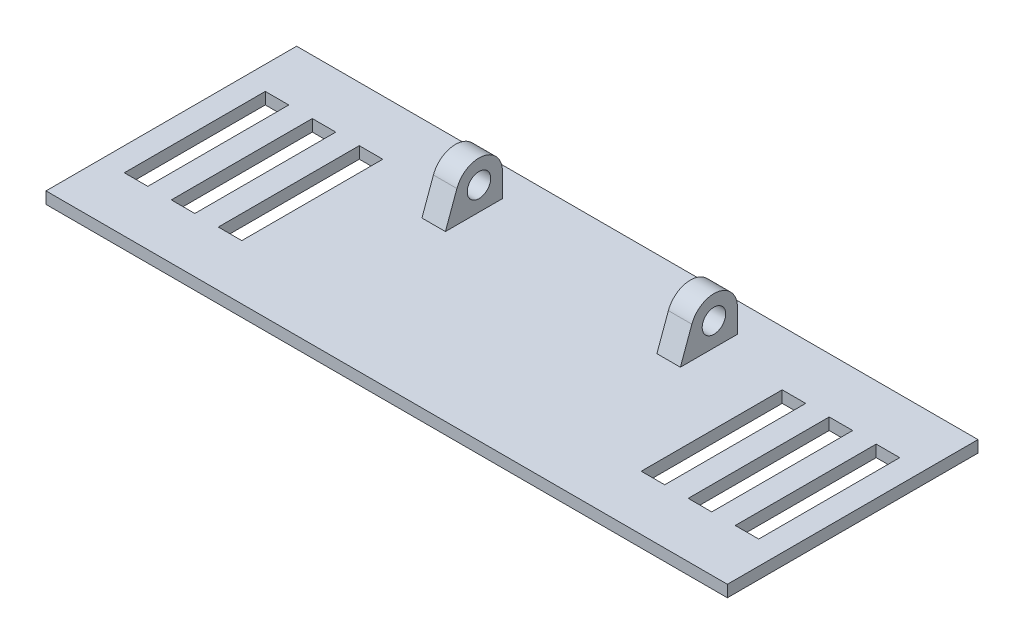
from build123d import *

# Parameters (mm, degrees)
SKETCH_1_W               = 91
SKETCH_1_H               = 36
EXTRUDE_1_DEPTH          = 17
SHELL_1_T                = -1.5
FILLET_1_R               = 2.5
CUT_EXTRUDE_1_REACH      = 53.327
SKETCH_2_W               = 72.5
SKETCH_2_H               = 23
EXTRUDE_2_DEPTH          = 6.5
MIRROR_2_COPY_1_DEPTH    = 6.5
CUT_EXTRUDE_2_REACH      = 96.308
SKETCH_4_W               = 13
SKETCH_4_H               = 7
SKETCH_5_W               = 87
SKETCH_5_H               = 32
EXTRUDE_3_DEPTH          = 1.5
SKETCH_6_W               = 3
SKETCH_6_H               = 18
CUT_EXTRUDE_3_DEPTH      = 1.5
PATTERN_LINEAR_1_COUNT   = 3
PATTERN_LINEAR_1_PITCH   = 6
MIRROR_3_COPY_1_SKETCH_W = 3
MIRROR_3_COPY_1_SKETCH_H = 18
MIRROR_3_COPY_1_DEPTH    = 1.5
MIRROR_3_COPY_2_SKETCH_W = 3
MIRROR_3_COPY_2_SKETCH_H = 18
MIRROR_3_COPY_2_DEPTH    = 1.5
EXTRUDE_4_DEPTH          = 1.5
SKETCH_8_R               = 1.5
CUT_EXTRUDE_4_DEPTH      = 3
CUT_EXTRUDE_START        = -17
SKETCH_9_W               = 91
SKETCH_9_H               = 36
CUT_EXTRUDE_5_DEPTH      = 17


with BuildPart() as part:
    # Sketch 1 → Extrude 1 (new body)
    with BuildSketch(Plane(origin=(0, 0, 0), x_dir=(1, 0, 0), z_dir=(0, 1, 0))):
        Rectangle(SKETCH_1_W, SKETCH_1_H)
    extrude(amount=EXTRUDE_1_DEPTH)

    # Shell 1
    shell_1_openings = [part.faces().sort_by_distance(p)[0] for p in [
        (0, 17, 0),
    ]]
    offset(amount=SHELL_1_T, openings=shell_1_openings, kind=Kind.INTERSECTION)

    # Fillet 1
    fillet_1_edges = [part.edges().sort_by_distance(p)[0] for p in [
        (45.5, 8.5, 18),
        (-45.5, 8.5, 18),
        (-45.5, 8.5, -18),
        (45.5, 8.5, -18),
    ]]
    fillet(fillet_1_edges, radius=FILLET_1_R)

    # Sketch 2 → Cut-Extrude 1 (cut, up to next)
    with BuildSketch(Plane(origin=(0, 1.5, 0), x_dir=(1, 0, 0), z_dir=(0, 1, 0)), mode=Mode.PRIVATE) as cut_extrude_1_sk1:
        Rectangle(SKETCH_2_W, SKETCH_2_H)
    cut_extrude_1_tool1 = extrude(cut_extrude_1_sk1.sketch, amount=-CUT_EXTRUDE_1_REACH, mode=Mode.PRIVATE) & part.part
    add(cut_extrude_1_tool1.solids().sort_by_distance((0, 1.5, 0))[0], mode=Mode.SUBTRACT)

    # Sketch 3 → Extrude 2 (add)
    with BuildSketch(Plane(origin=(0, 1.5, 0), x_dir=(1, 0, 0), z_dir=(0, 1, 0))):
        with BuildLine():
            Line((-44, 16.5), (-41, 16.5))
            ThreePointArc((-41, 16.5), (-38.878679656, 11.378679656), (-44, 13.5))
            Line((-44, 13.5), (-44, 16.5))
        make_face()
    extrude_2 = extrude(amount=EXTRUDE_2_DEPTH)

    # Mirror 1: Extrude 2 across plane
    add(extrude_2.mirror(Plane(origin=(0, 0, 0), x_dir=(0, 0, 1), z_dir=(1, 0, 0))))

    # Mirror 2: Extrude 2 across plane
    add(extrude_2.mirror(Plane.XY))

    # Mirror 2 copy 1 sketch → Mirror 2 copy 1 (add)
    with BuildSketch(Plane(origin=(0, 1.5, 0), x_dir=(-1, 0, 0), z_dir=(0, 1, 0))):
        with BuildLine():
            Line((-44, 16.5), (-41, 16.5))
            ThreePointArc((-41, 16.5), (-38.878679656, 11.378679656), (-44, 13.5))
            Line((-44, 13.5), (-44, 16.5))
        make_face()
    extrude(amount=MIRROR_2_COPY_1_DEPTH)

    # Sketch 4 → Cut-Extrude 2 (cut, up to next)
    with BuildSketch(Plane(origin=(45.5, 0, 0), x_dir=(0, 0, -1), z_dir=(1, 0, 0)), mode=Mode.PRIVATE) as cut_extrude_2_sk1:
        with Locations((0, 12)):
            Rectangle(SKETCH_4_W, SKETCH_4_H)
    cut_extrude_2_tool1 = extrude(cut_extrude_2_sk1.sketch, amount=-CUT_EXTRUDE_2_REACH, mode=Mode.PRIVATE) & part.part
    add(cut_extrude_2_tool1.solids().sort_by_distance((45.5, 12, 0))[0], mode=Mode.SUBTRACT)

    # Sketch 9 → Cut-Extrude 5 (cut)
    with BuildSketch(Plane(origin=(0, 17, 0), x_dir=(1, 0, 0), z_dir=(0, 1, 0)).offset(CUT_EXTRUDE_START)):
        Rectangle(SKETCH_9_W, SKETCH_9_H)
    extrude(amount=CUT_EXTRUDE_5_DEPTH, mode=Mode.SUBTRACT)


with BuildPart() as body_2:
    # Sketch 5 → Extrude 3 (new body)
    with BuildSketch(Plane(origin=(0, 17, 0), x_dir=(1, 0, 0), z_dir=(0, 1, 0))):
        Rectangle(SKETCH_5_W, SKETCH_5_H)
    extrude(amount=EXTRUDE_3_DEPTH)

    # Sketch 6 → Cut-Extrude 3 (cut)
    with BuildSketch(Plane(origin=(0, 18.5, 0), x_dir=(1, 0, 0), z_dir=(0, 1, 0))):
        with Locations((-39, 0)):
            Rectangle(SKETCH_6_W, SKETCH_6_H)
    cut_extrude_3 = extrude(amount=-CUT_EXTRUDE_3_DEPTH, mode=Mode.SUBTRACT)

    # Pattern Linear 1: Cut-Extrude 3 ×3
    with Locations(*[(i * PATTERN_LINEAR_1_PITCH, 0, 0) for i in range(1, PATTERN_LINEAR_1_COUNT)]):
        add(cut_extrude_3, mode=Mode.SUBTRACT)

    # Mirror 3: Cut-Extrude 3 across plane
    add(cut_extrude_3.mirror(Plane(origin=(0, 0, 0), x_dir=(0, 0, 1), z_dir=(1, 0, 0))), mode=Mode.SUBTRACT)

    # Mirror 3 copy 1 sketch → Mirror 3 copy 1 (cut)
    with BuildSketch(Plane(origin=(-6, 18.5, 0), x_dir=(-1, 0, 0), z_dir=(0, 1, 0))):
        with Locations((-39, 0)):
            Rectangle(MIRROR_3_COPY_1_SKETCH_W, MIRROR_3_COPY_1_SKETCH_H)
    extrude(amount=-MIRROR_3_COPY_1_DEPTH, mode=Mode.SUBTRACT)

    # Mirror 3 copy 2 sketch → Mirror 3 copy 2 (cut)
    with BuildSketch(Plane(origin=(-12, 18.5, 0), x_dir=(-1, 0, 0), z_dir=(0, 1, 0))):
        with Locations((-39, 0)):
            Rectangle(MIRROR_3_COPY_2_SKETCH_W, MIRROR_3_COPY_2_SKETCH_H)
    extrude(amount=-MIRROR_3_COPY_2_DEPTH, mode=Mode.SUBTRACT)

    # Sketch 7 → Extrude 4 (add, symmetric)
    with BuildSketch(Plane(origin=(-15, 0, 0), x_dir=(0, 0, -1), z_dir=(1, 0, 0))):
        with BuildLine():
            Line((6.464733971, 22.52606043), (4.999367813, 18.5))
            Line((4.999367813, 18.5), (12.283811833, 18.5))
            Line((12.283811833, 18.5), (12.283811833, 21.5))
            ThreePointArc((12.283811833, 21.5), (9.804756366, 24.454423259), (6.464733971, 22.52606043))
        make_face()
    extrude_4 = extrude(amount=EXTRUDE_4_DEPTH, both=True)

    # Sketch 8 → Cut-Extrude 4 (cut)
    with BuildSketch(Plane(origin=(-13.5, 0, 0), x_dir=(0, 0, -1), z_dir=(1, 0, 0))):
        with Locations((9.283811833, 21.5)):
            Circle(SKETCH_8_R)
    cut_extrude_4 = extrude(amount=-CUT_EXTRUDE_4_DEPTH, mode=Mode.SUBTRACT)

    # Mirror 4: Extrude 4, Cut-Extrude 4 across plane
    add(extrude_4.mirror(Plane(origin=(0, 0, 0), x_dir=(0, 0, 1), z_dir=(1, 0, 0))))
    add(cut_extrude_4.mirror(Plane(origin=(0, 0, 0), x_dir=(0, 0, 1), z_dir=(1, 0, 0))), mode=Mode.SUBTRACT)


solid = body_2.part
